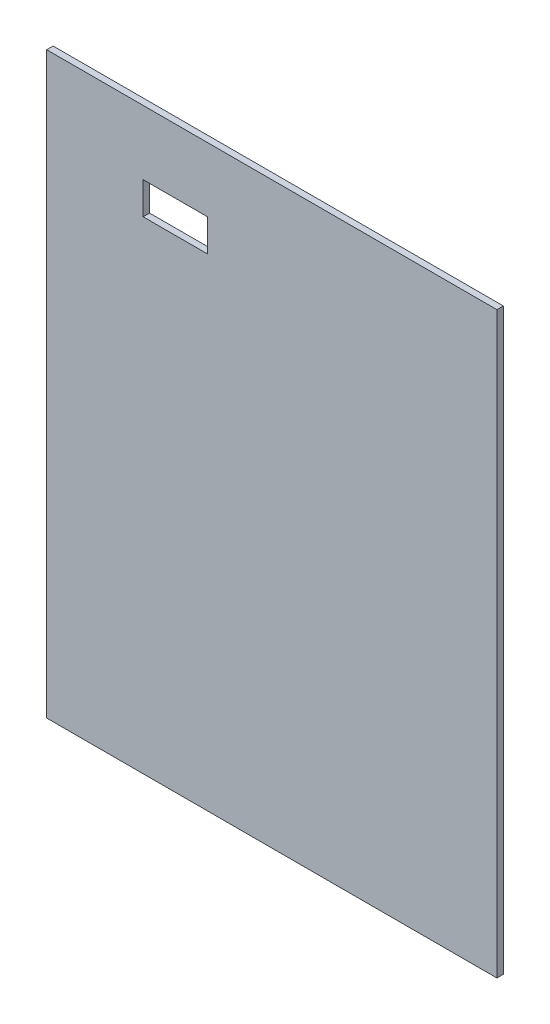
from build123d import *

# Parameters (mm, degrees)
SKETCH1_W           = 350
SKETCH1_H           = 450
BOSS_EXTRUDE1_DEPTH = 5
SKETCH2_W           = 50
SKETCH2_H           = 25
CUT_EXTRUDE1_DEPTH  = 571.109638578


with BuildPart() as part:
    # Sketch1 → Boss-Extrude1 (new body)
    with BuildSketch(Plane.XY):
        with Locations((175, 225)):
            Rectangle(SKETCH1_W, SKETCH1_H)
    extrude(amount=BOSS_EXTRUDE1_DEPTH)

    # Sketch2 → Cut-Extrude1 (cut, through all)
    with BuildSketch(Plane.XY.offset(5)):
        with Locations((100, 387.5)):
            Rectangle(SKETCH2_W, SKETCH2_H)
    extrude(amount=-CUT_EXTRUDE1_DEPTH, mode=Mode.SUBTRACT)


solid = part.part
